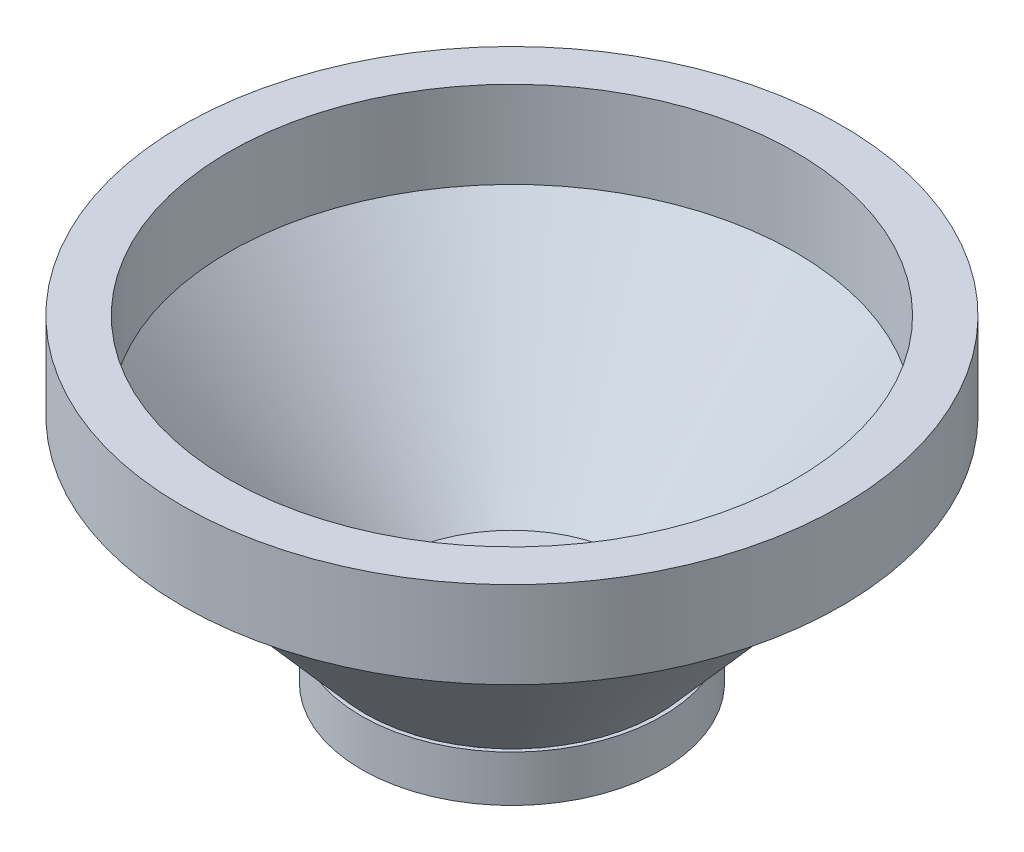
ISO-10303-21;
HEADER;
FILE_DESCRIPTION(('STEP AP214'),'2;1');
FILE_NAME('part.step','',(''),(''),'','','');
FILE_SCHEMA(('AUTOMOTIVE_DESIGN { 1 0 10303 214 1 1 1 1 }'));
ENDSEC;
DATA;
#1=APPLICATION_CONTEXT('core data for automotive mechanical design processes');
#2=APPLICATION_PROTOCOL_DEFINITION('international standard','automotive_design',2000,#1);
#3=PRODUCT_CONTEXT('',#1,'mechanical');
#4=PRODUCT('Part','Part','',(#3));
#5=PRODUCT_RELATED_PRODUCT_CATEGORY('part','',(#4));
#6=PRODUCT_DEFINITION_FORMATION('','',#4);
#7=PRODUCT_DEFINITION_CONTEXT('part definition',#1,'design');
#8=PRODUCT_DEFINITION('design','',#6,#7);
#9=PRODUCT_DEFINITION_SHAPE('','',#8);
#10=(LENGTH_UNIT() NAMED_UNIT(*) SI_UNIT(.MILLI.,.METRE.));
#11=(NAMED_UNIT(*) PLANE_ANGLE_UNIT() SI_UNIT($,.RADIAN.));
#12=(NAMED_UNIT(*) SI_UNIT($,.STERADIAN.) SOLID_ANGLE_UNIT());
#13=UNCERTAINTY_MEASURE_WITH_UNIT(LENGTH_MEASURE(1.E-05),#10,'distance_accuracy_value','');
#14=(GEOMETRIC_REPRESENTATION_CONTEXT(3) GLOBAL_UNCERTAINTY_ASSIGNED_CONTEXT((#13)) GLOBAL_UNIT_ASSIGNED_CONTEXT((#10,
#11,#12)) REPRESENTATION_CONTEXT('',''));
#15=CARTESIAN_POINT('',(0.,0.,0.));
#16=DIRECTION('',(0.,0.,1.));
#17=DIRECTION('',(1.,0.,0.));
#18=AXIS2_PLACEMENT_3D('',#15,#16,#17);
#19=CARTESIAN_POINT('',(0.,6.35,0.));
#20=DIRECTION('',(0.,1.,0.));
#21=DIRECTION('',(0.,0.,1.));
#22=AXIS2_PLACEMENT_3D('',#19,#20,#21);
#23=PLANE('',#22);
#24=CARTESIAN_POINT('',(0.,6.35,0.));
#25=DIRECTION('',(0.,1.,0.));
#26=DIRECTION('',(0.,0.,1.));
#27=AXIS2_PLACEMENT_3D('',#24,#25,#26);
#28=CIRCLE('',#27,12.8984375);
#29=CARTESIAN_POINT('',(0.,6.35,12.8984375));
#30=VERTEX_POINT('',#29);
#31=EDGE_CURVE('E56',#30,#30,#28,.T.);
#32=ORIENTED_EDGE('',*,*,#31,.F.);
#33=EDGE_LOOP('',(#32));
#34=FACE_BOUND('',#33,.T.);
#35=CARTESIAN_POINT('',(0.,6.35,0.));
#36=DIRECTION('',(0.,1.,0.));
#37=DIRECTION('',(0.,0.,1.));
#38=AXIS2_PLACEMENT_3D('',#35,#36,#37);
#39=CIRCLE('',#38,16.66875);
#40=CARTESIAN_POINT('',(0.,6.35,16.66875));
#41=VERTEX_POINT('',#40);
#42=EDGE_CURVE('E81',#41,#41,#39,.T.);
#43=ORIENTED_EDGE('',*,*,#42,.T.);
#44=EDGE_LOOP('',(#43));
#45=FACE_BOUND('',#44,.T.);
#46=ADVANCED_FACE('F35',(#34,#45),#23,.T.);
#47=CARTESIAN_POINT('',(0.,6.35,0.));
#48=DIRECTION('',(0.,1.,0.));
#49=DIRECTION('',(0.,0.,1.));
#50=AXIS2_PLACEMENT_3D('',#47,#48,#49);
#51=CIRCLE('',#50,20.1079476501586);
#52=CARTESIAN_POINT('',(0.,6.35,20.1079476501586));
#53=VERTEX_POINT('',#52);
#54=EDGE_CURVE('E11',#53,#53,#51,.T.);
#55=ORIENTED_EDGE('',*,*,#54,.F.);
#56=EDGE_LOOP('',(#55));
#57=FACE_BOUND('',#56,.T.);
#58=CARTESIAN_POINT('',(0.,6.35,0.));
#59=DIRECTION('',(0.,1.,0.));
#60=DIRECTION('',(0.,0.,1.));
#61=AXIS2_PLACEMENT_3D('',#58,#59,#60);
#62=CIRCLE('',#61,20.6375);
#63=CARTESIAN_POINT('',(0.,6.35,20.6375));
#64=VERTEX_POINT('',#63);
#65=EDGE_CURVE('E45',#64,#64,#62,.T.);
#66=ORIENTED_EDGE('',*,*,#65,.T.);
#67=EDGE_LOOP('',(#66));
#68=FACE_BOUND('',#67,.T.);
#69=ADVANCED_FACE('F107',(#57,#68),#23,.T.);
#70=CARTESIAN_POINT('',(0.,0.,0.));
#71=DIRECTION('',(0.,1.,0.));
#72=DIRECTION('',(0.,0.,1.));
#73=AXIS2_PLACEMENT_3D('',#70,#71,#72);
#74=PLANE('',#73);
#75=CARTESIAN_POINT('',(0.,0.,0.));
#76=DIRECTION('',(0.,1.,0.));
#77=DIRECTION('',(0.,0.,1.));
#78=AXIS2_PLACEMENT_3D('',#75,#76,#77);
#79=CIRCLE('',#78,20.6375);
#80=CARTESIAN_POINT('',(0.,0.,20.6375));
#81=VERTEX_POINT('',#80);
#82=EDGE_CURVE('E50',#81,#81,#79,.T.);
#83=ORIENTED_EDGE('',*,*,#82,.F.);
#84=EDGE_LOOP('',(#83));
#85=FACE_BOUND('',#84,.T.);
#86=CARTESIAN_POINT('',(0.,0.,0.));
#87=DIRECTION('',(0.,1.,0.));
#88=DIRECTION('',(0.,0.,1.));
#89=AXIS2_PLACEMENT_3D('',#86,#87,#88);
#90=CIRCLE('',#89,12.8984375);
#91=CARTESIAN_POINT('',(0.,0.,12.8984375));
#92=VERTEX_POINT('',#91);
#93=EDGE_CURVE('E59',#92,#92,#90,.T.);
#94=ORIENTED_EDGE('',*,*,#93,.T.);
#95=EDGE_LOOP('',(#94));
#96=FACE_BOUND('',#95,.T.);
#97=ADVANCED_FACE('F109',(#85,#96),#74,.F.);
#98=CARTESIAN_POINT('',(0.,6.35,0.));
#99=DIRECTION('',(0.,-1.,0.));
#100=DIRECTION('',(0.,0.,-1.));
#101=AXIS2_PLACEMENT_3D('',#98,#99,#100);
#102=CYLINDRICAL_SURFACE('',#101,20.6375);
#103=ORIENTED_EDGE('',*,*,#65,.F.);
#104=EDGE_LOOP('',(#103));
#105=FACE_BOUND('',#104,.T.);
#106=ORIENTED_EDGE('',*,*,#82,.T.);
#107=EDGE_LOOP('',(#106));
#108=FACE_BOUND('',#107,.T.);
#109=ADVANCED_FACE('F37',(#105,#108),#102,.T.);
#110=CARTESIAN_POINT('',(0.,6.35,0.));
#111=DIRECTION('',(0.,-1.,0.));
#112=DIRECTION('',(0.,0.,-1.));
#113=AXIS2_PLACEMENT_3D('',#110,#111,#112);
#114=CYLINDRICAL_SURFACE('',#113,12.8984375);
#115=ORIENTED_EDGE('',*,*,#31,.T.);
#116=EDGE_LOOP('',(#115));
#117=FACE_BOUND('',#116,.T.);
#118=ORIENTED_EDGE('',*,*,#93,.F.);
#119=EDGE_LOOP('',(#118));
#120=FACE_BOUND('',#119,.T.);
#121=ADVANCED_FACE('F102',(#117,#120),#114,.F.);
#122=CARTESIAN_POINT('',(0.,4.64561886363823,0.));
#123=DIRECTION('',(0.,1.,0.));
#124=DIRECTION('',(0.,0.,1.));
#125=AXIS2_PLACEMENT_3D('',#122,#123,#124);
#126=CONICAL_SURFACE('',#125,18.616614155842,0.718829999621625);
#127=CARTESIAN_POINT('',(0.,31.75,0.));
#128=DIRECTION('',(0.,1.,0.));
#129=DIRECTION('',(0.,0.,1.));
#130=AXIS2_PLACEMENT_3D('',#127,#128,#129);
#131=CIRCLE('',#130,42.3329476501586);
#132=CARTESIAN_POINT('',(0.,31.75,42.3329476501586));
#133=VERTEX_POINT('',#132);
#134=EDGE_CURVE('E54',#133,#133,#131,.T.);
#135=ORIENTED_EDGE('',*,*,#134,.F.);
#136=EDGE_LOOP('',(#135));
#137=FACE_BOUND('',#136,.T.);
#138=ORIENTED_EDGE('',*,*,#54,.T.);
#139=EDGE_LOOP('',(#138));
#140=FACE_BOUND('',#139,.T.);
#141=ADVANCED_FACE('F97',(#137,#140),#126,.T.);
#142=CARTESIAN_POINT('',(0.,6.35,0.));
#143=DIRECTION('',(0.,1.,0.));
#144=DIRECTION('',(0.,0.,1.));
#145=AXIS2_PLACEMENT_3D('',#142,#143,#144);
#146=CONICAL_SURFACE('',#145,16.66875,0.718829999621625);
#147=CARTESIAN_POINT('',(0.,31.75,0.));
#148=DIRECTION('',(0.,1.,0.));
#149=DIRECTION('',(0.,0.,-1.));
#150=AXIS2_PLACEMENT_3D('',#147,#148,#149);
#151=CIRCLE('',#150,38.89375);
#152=CARTESIAN_POINT('',(0.,31.75,-38.89375));
#153=VERTEX_POINT('',#152);
#154=EDGE_CURVE('E66',#153,#153,#151,.T.);
#155=ORIENTED_EDGE('',*,*,#154,.T.);
#156=EDGE_LOOP('',(#155));
#157=FACE_BOUND('',#156,.T.);
#158=ORIENTED_EDGE('',*,*,#42,.F.);
#159=EDGE_LOOP('',(#158));
#160=FACE_BOUND('',#159,.T.);
#161=ADVANCED_FACE('F86',(#157,#160),#146,.F.);
#162=CARTESIAN_POINT('',(0.,43.65625,0.));
#163=DIRECTION('',(0.,1.,0.));
#164=DIRECTION('',(0.,0.,1.));
#165=AXIS2_PLACEMENT_3D('',#162,#163,#164);
#166=PLANE('',#165);
#167=CARTESIAN_POINT('',(0.,43.65625,0.));
#168=DIRECTION('',(0.,1.,0.));
#169=DIRECTION('',(0.,0.,1.));
#170=AXIS2_PLACEMENT_3D('',#167,#168,#169);
#171=CIRCLE('',#170,45.24375);
#172=CARTESIAN_POINT('',(0.,43.65625,45.24375));
#173=VERTEX_POINT('',#172);
#174=EDGE_CURVE('E77',#173,#173,#171,.T.);
#175=ORIENTED_EDGE('',*,*,#174,.T.);
#176=EDGE_LOOP('',(#175));
#177=FACE_BOUND('',#176,.T.);
#178=CARTESIAN_POINT('',(0.,43.65625,0.));
#179=DIRECTION('',(0.,1.,0.));
#180=DIRECTION('',(0.,0.,1.));
#181=AXIS2_PLACEMENT_3D('',#178,#179,#180);
#182=CIRCLE('',#181,38.89375);
#183=CARTESIAN_POINT('',(0.,43.65625,38.89375));
#184=VERTEX_POINT('',#183);
#185=EDGE_CURVE('E70',#184,#184,#182,.T.);
#186=ORIENTED_EDGE('',*,*,#185,.F.);
#187=EDGE_LOOP('',(#186));
#188=FACE_BOUND('',#187,.T.);
#189=ADVANCED_FACE('F96',(#177,#188),#166,.T.);
#190=CARTESIAN_POINT('',(0.,31.75,0.));
#191=DIRECTION('',(0.,1.,0.));
#192=DIRECTION('',(0.,0.,1.));
#193=AXIS2_PLACEMENT_3D('',#190,#191,#192);
#194=PLANE('',#193);
#195=ORIENTED_EDGE('',*,*,#134,.T.);
#196=EDGE_LOOP('',(#195));
#197=FACE_BOUND('',#196,.T.);
#198=CARTESIAN_POINT('',(0.,31.75,0.));
#199=DIRECTION('',(0.,1.,0.));
#200=DIRECTION('',(0.,0.,1.));
#201=AXIS2_PLACEMENT_3D('',#198,#199,#200);
#202=CIRCLE('',#201,45.24375);
#203=CARTESIAN_POINT('',(0.,31.75,45.24375));
#204=VERTEX_POINT('',#203);
#205=EDGE_CURVE('E72',#204,#204,#202,.T.);
#206=ORIENTED_EDGE('',*,*,#205,.F.);
#207=EDGE_LOOP('',(#206));
#208=FACE_BOUND('',#207,.T.);
#209=ADVANCED_FACE('F131',(#197,#208),#194,.F.);
#210=CARTESIAN_POINT('',(0.,43.65625,0.));
#211=DIRECTION('',(0.,-1.,0.));
#212=DIRECTION('',(0.,0.,-1.));
#213=AXIS2_PLACEMENT_3D('',#210,#211,#212);
#214=CYLINDRICAL_SURFACE('',#213,45.24375);
#215=ORIENTED_EDGE('',*,*,#174,.F.);
#216=EDGE_LOOP('',(#215));
#217=FACE_BOUND('',#216,.T.);
#218=ORIENTED_EDGE('',*,*,#205,.T.);
#219=EDGE_LOOP('',(#218));
#220=FACE_BOUND('',#219,.T.);
#221=ADVANCED_FACE('F98',(#217,#220),#214,.T.);
#222=CARTESIAN_POINT('',(0.,43.65625,0.));
#223=DIRECTION('',(0.,-1.,0.));
#224=DIRECTION('',(0.,0.,-1.));
#225=AXIS2_PLACEMENT_3D('',#222,#223,#224);
#226=CYLINDRICAL_SURFACE('',#225,38.89375);
#227=ORIENTED_EDGE('',*,*,#185,.T.);
#228=EDGE_LOOP('',(#227));
#229=FACE_BOUND('',#228,.T.);
#230=ORIENTED_EDGE('',*,*,#154,.F.);
#231=EDGE_LOOP('',(#230));
#232=FACE_BOUND('',#231,.T.);
#233=ADVANCED_FACE('F67',(#229,#232),#226,.F.);
#234=CLOSED_SHELL('',(#46,#69,#97,#109,#121,#141,#161,#189,#209,#221,#233));
#235=MANIFOLD_SOLID_BREP('B2',#234);
#236=ADVANCED_BREP_SHAPE_REPRESENTATION('',(#18,#235),#14);
#237=SHAPE_DEFINITION_REPRESENTATION(#9,#236);
ENDSEC;
END-ISO-10303-21;
